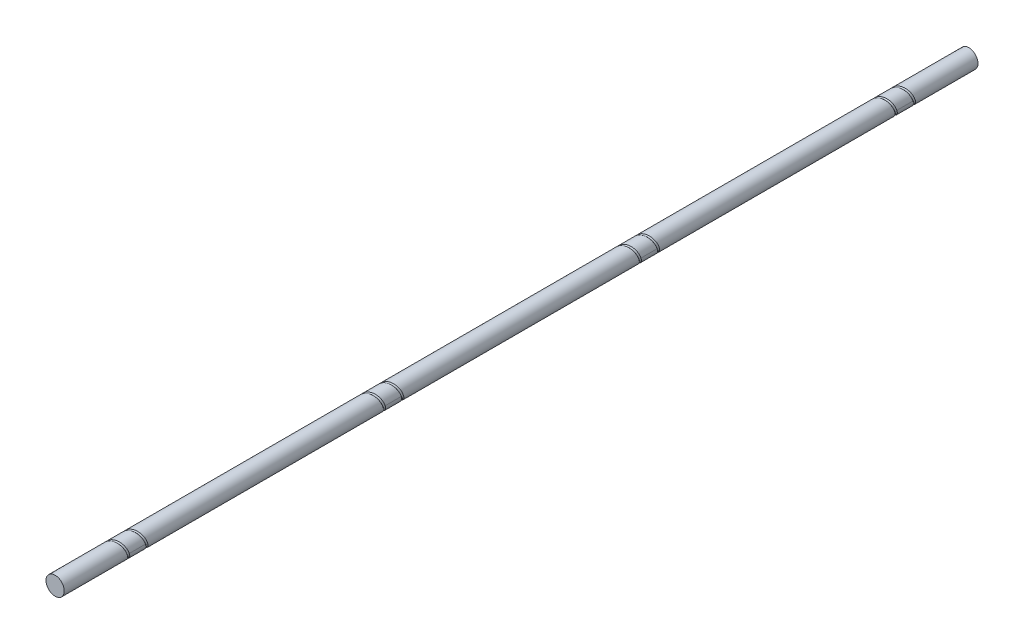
from build123d import *

# Parameters (mm, degrees)
SKETCH1_R              = 25
BOSS_EXTRUDE1_DEPTH    = 2500
CUT_SWEEP1_PITCH       = 50
CUT_SWEEP1_HEIGHT      = 100
CUT_SWEEP1_RADIUS      = 27.646
CUT_SWEEP1_START_ANGLE = -180
SKETCH3_R              = 3.969
LPATTERN1_COUNT        = 4
LPATTERN1_PITCH        = 700


with BuildPart() as part:
    # Sketch1 → Boss-Extrude1 (new body)
    with BuildSketch(Plane.XY):
        Circle(SKETCH1_R)
    extrude(amount=BOSS_EXTRUDE1_DEPTH)

    # Cut-Sweep1: sweep along a helix
    with BuildLine() as cut_sweep1_path:
        add(Helix(CUT_SWEEP1_PITCH, CUT_SWEEP1_HEIGHT, CUT_SWEEP1_RADIUS, center=(0, 0, 150), direction=(0, 0, 1), mode=Mode.PRIVATE).rotate(Axis((0, 0, 150), (0, 0, 1)), CUT_SWEEP1_START_ANGLE))
    # Sketch3 → Cut-Sweep1 (sweep, cut)
    with BuildSketch(Plane(origin=(0, 0, 0), x_dir=(1, 0, 0), z_dir=(0, 1, 0))):
        with Locations((-27.646, -150)):
            Circle(SKETCH3_R)
    cut_sweep1 = sweep(path=cut_sweep1_path.line, is_frenet=True, mode=Mode.SUBTRACT)

    # LPattern1: Cut-Sweep1 ×4
    with Locations(*[(0, 0, i * LPATTERN1_PITCH) for i in range(1, LPATTERN1_COUNT)]):
        add(cut_sweep1, mode=Mode.SUBTRACT)


solid = part.part
